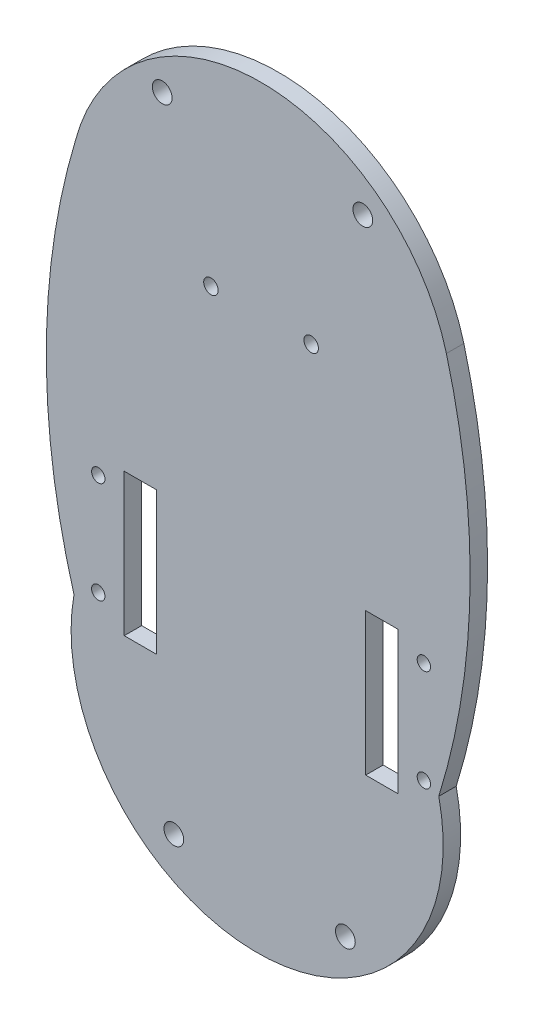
ISO-10303-21;
HEADER;
FILE_DESCRIPTION(('STEP AP214'),'2;1');
FILE_NAME('part.step','',(''),(''),'','','');
FILE_SCHEMA(('AUTOMOTIVE_DESIGN { 1 0 10303 214 1 1 1 1 }'));
ENDSEC;
DATA;
#1=APPLICATION_CONTEXT('core data for automotive mechanical design processes');
#2=APPLICATION_PROTOCOL_DEFINITION('international standard','automotive_design',2000,#1);
#3=PRODUCT_CONTEXT('',#1,'mechanical');
#4=PRODUCT('Part','Part','',(#3));
#5=PRODUCT_RELATED_PRODUCT_CATEGORY('part','',(#4));
#6=PRODUCT_DEFINITION_FORMATION('','',#4);
#7=PRODUCT_DEFINITION_CONTEXT('part definition',#1,'design');
#8=PRODUCT_DEFINITION('design','',#6,#7);
#9=PRODUCT_DEFINITION_SHAPE('','',#8);
#10=(LENGTH_UNIT() NAMED_UNIT(*) SI_UNIT(.MILLI.,.METRE.));
#11=(NAMED_UNIT(*) PLANE_ANGLE_UNIT() SI_UNIT($,.RADIAN.));
#12=(NAMED_UNIT(*) SI_UNIT($,.STERADIAN.) SOLID_ANGLE_UNIT());
#13=UNCERTAINTY_MEASURE_WITH_UNIT(LENGTH_MEASURE(1.E-05),#10,'distance_accuracy_value','');
#14=(GEOMETRIC_REPRESENTATION_CONTEXT(3) GLOBAL_UNCERTAINTY_ASSIGNED_CONTEXT((#13)) GLOBAL_UNIT_ASSIGNED_CONTEXT((#10,
#11,#12)) REPRESENTATION_CONTEXT('',''));
#15=CARTESIAN_POINT('',(0.,0.,0.));
#16=DIRECTION('',(0.,0.,1.));
#17=DIRECTION('',(1.,0.,0.));
#18=AXIS2_PLACEMENT_3D('',#15,#16,#17);
#19=CARTESIAN_POINT('',(41.1941527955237,-78.4757231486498,3.));
#20=DIRECTION('',(0.,0.,1.));
#21=DIRECTION('',(1.,0.,0.));
#22=AXIS2_PLACEMENT_3D('',#19,#20,#21);
#23=PLANE('',#22);
#24=CARTESIAN_POINT('',(-8.62,-34.7075503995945,3.));
#25=DIRECTION('',(0.,0.,1.));
#26=DIRECTION('',(1.,0.,0.));
#27=AXIS2_PLACEMENT_3D('',#24,#25,#26);
#28=CIRCLE('',#27,1.25);
#29=CARTESIAN_POINT('',(-7.37,-34.7075503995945,3.));
#30=VERTEX_POINT('',#29);
#31=EDGE_CURVE('E334',#30,#30,#28,.T.);
#32=ORIENTED_EDGE('',*,*,#31,.F.);
#33=EDGE_LOOP('',(#32));
#34=FACE_BOUND('',#33,.T.);
#35=CARTESIAN_POINT('',(8.62,-34.7075503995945,3.));
#36=DIRECTION('',(0.,0.,1.));
#37=DIRECTION('',(1.,0.,0.));
#38=AXIS2_PLACEMENT_3D('',#35,#36,#37);
#39=CIRCLE('',#38,1.25);
#40=CARTESIAN_POINT('',(9.87,-34.7075503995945,3.));
#41=VERTEX_POINT('',#40);
#42=EDGE_CURVE('E341',#41,#41,#39,.T.);
#43=ORIENTED_EDGE('',*,*,#42,.F.);
#44=EDGE_LOOP('',(#43));
#45=FACE_BOUND('',#44,.T.);
#46=DIRECTION('',(0.,1.,0.));
#47=VECTOR('',#46,1.);
#48=CARTESIAN_POINT('',(-18.,-69.7075503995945,3.));
#49=LINE('',#48,#47);
#50=CARTESIAN_POINT('',(-18.,-94.2075503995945,3.));
#51=VERTEX_POINT('',#50);
#52=CARTESIAN_POINT('',(-18.,-69.7075503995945,3.));
#53=VERTEX_POINT('',#52);
#54=EDGE_CURVE('E63',#51,#53,#49,.T.);
#55=ORIENTED_EDGE('',*,*,#54,.F.);
#56=DIRECTION('',(1.,0.,0.));
#57=VECTOR('',#56,1.);
#58=CARTESIAN_POINT('',(-23.5341140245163,-94.2075503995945,3.));
#59=LINE('',#58,#57);
#60=CARTESIAN_POINT('',(-23.5341140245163,-94.2075503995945,3.));
#61=VERTEX_POINT('',#60);
#62=EDGE_CURVE('E162',#61,#51,#59,.T.);
#63=ORIENTED_EDGE('',*,*,#62,.F.);
#64=DIRECTION('',(0.,-1.,0.));
#65=VECTOR('',#64,1.);
#66=CARTESIAN_POINT('',(-23.5341140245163,-69.7075503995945,3.));
#67=LINE('',#66,#65);
#68=CARTESIAN_POINT('',(-23.5341140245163,-69.7075503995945,3.));
#69=VERTEX_POINT('',#68);
#70=EDGE_CURVE('E144',#69,#61,#67,.T.);
#71=ORIENTED_EDGE('',*,*,#70,.F.);
#72=DIRECTION('',(-1.,0.,0.));
#73=VECTOR('',#72,1.);
#74=CARTESIAN_POINT('',(-23.5341140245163,-69.7075503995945,3.));
#75=LINE('',#74,#73);
#76=EDGE_CURVE('E155',#53,#69,#75,.T.);
#77=ORIENTED_EDGE('',*,*,#76,.F.);
#78=EDGE_LOOP('',(#55,#63,#71,#77));
#79=FACE_BOUND('',#78,.T.);
#80=DIRECTION('',(0.,1.,0.));
#81=VECTOR('',#80,1.);
#82=CARTESIAN_POINT('',(23.53,-69.7075503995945,3.));
#83=LINE('',#82,#81);
#84=CARTESIAN_POINT('',(23.53,-94.2075503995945,3.));
#85=VERTEX_POINT('',#84);
#86=CARTESIAN_POINT('',(23.53,-69.7075503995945,3.));
#87=VERTEX_POINT('',#86);
#88=EDGE_CURVE('E71',#85,#87,#83,.T.);
#89=ORIENTED_EDGE('',*,*,#88,.F.);
#90=DIRECTION('',(1.,0.,0.));
#91=VECTOR('',#90,1.);
#92=CARTESIAN_POINT('',(18.,-94.2075503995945,3.));
#93=LINE('',#92,#91);
#94=CARTESIAN_POINT('',(18.,-94.2075503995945,3.));
#95=VERTEX_POINT('',#94);
#96=EDGE_CURVE('E180',#95,#85,#93,.T.);
#97=ORIENTED_EDGE('',*,*,#96,.F.);
#98=DIRECTION('',(0.,-1.,0.));
#99=VECTOR('',#98,1.);
#100=CARTESIAN_POINT('',(18.,-69.7075503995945,3.));
#101=LINE('',#100,#99);
#102=CARTESIAN_POINT('',(18.,-69.7075503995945,3.));
#103=VERTEX_POINT('',#102);
#104=EDGE_CURVE('E193',#103,#95,#101,.T.);
#105=ORIENTED_EDGE('',*,*,#104,.F.);
#106=DIRECTION('',(-1.,0.,0.));
#107=VECTOR('',#106,1.);
#108=CARTESIAN_POINT('',(18.,-69.7075503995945,3.));
#109=LINE('',#108,#107);
#110=EDGE_CURVE('E197',#87,#103,#109,.T.);
#111=ORIENTED_EDGE('',*,*,#110,.F.);
#112=EDGE_LOOP('',(#89,#97,#105,#111));
#113=FACE_BOUND('',#112,.T.);
#114=CARTESIAN_POINT('',(-28.,-72.54,3.));
#115=DIRECTION('',(0.,0.,1.));
#116=DIRECTION('',(-1.,0.,0.));
#117=AXIS2_PLACEMENT_3D('',#114,#115,#116);
#118=CIRCLE('',#117,1.14999999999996);
#119=CARTESIAN_POINT('',(-29.15,-72.54,3.));
#120=VERTEX_POINT('',#119);
#121=EDGE_CURVE('E211',#120,#120,#118,.T.);
#122=ORIENTED_EDGE('',*,*,#121,.F.);
#123=EDGE_LOOP('',(#122));
#124=FACE_BOUND('',#123,.T.);
#125=CARTESIAN_POINT('',(-15.,-119.5,3.));
#126=DIRECTION('',(0.,0.,1.));
#127=DIRECTION('',(1.,0.,0.));
#128=AXIS2_PLACEMENT_3D('',#125,#126,#127);
#129=CIRCLE('',#128,1.70000000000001);
#130=CARTESIAN_POINT('',(-13.3,-119.5,3.));
#131=VERTEX_POINT('',#130);
#132=EDGE_CURVE('E227',#131,#131,#129,.T.);
#133=ORIENTED_EDGE('',*,*,#132,.F.);
#134=EDGE_LOOP('',(#133));
#135=FACE_BOUND('',#134,.T.);
#136=CARTESIAN_POINT('',(28.,-72.54,3.));
#137=DIRECTION('',(0.,0.,1.));
#138=DIRECTION('',(1.,0.,0.));
#139=AXIS2_PLACEMENT_3D('',#136,#137,#138);
#140=CIRCLE('',#139,1.14999999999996);
#141=CARTESIAN_POINT('',(29.15,-72.54,3.));
#142=VERTEX_POINT('',#141);
#143=EDGE_CURVE('E243',#142,#142,#140,.T.);
#144=ORIENTED_EDGE('',*,*,#143,.F.);
#145=EDGE_LOOP('',(#144));
#146=FACE_BOUND('',#145,.T.);
#147=CARTESIAN_POINT('',(14.5,-120.,3.));
#148=DIRECTION('',(0.,0.,1.));
#149=DIRECTION('',(1.,0.,0.));
#150=AXIS2_PLACEMENT_3D('',#147,#148,#149);
#151=CIRCLE('',#150,1.7);
#152=CARTESIAN_POINT('',(16.2,-120.,3.));
#153=VERTEX_POINT('',#152);
#154=EDGE_CURVE('E259',#153,#153,#151,.T.);
#155=ORIENTED_EDGE('',*,*,#154,.F.);
#156=EDGE_LOOP('',(#155));
#157=FACE_BOUND('',#156,.T.);
#158=CARTESIAN_POINT('',(83.0626903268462,-58.9443393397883,3.));
#159=DIRECTION('',(0.,0.,1.));
#160=DIRECTION('',(1.,0.,0.));
#161=AXIS2_PLACEMENT_3D('',#158,#159,#160);
#162=CIRCLE('',#161,120.);
#163=CARTESIAN_POINT('',(-31.8770093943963,-24.4644114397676,3.));
#164=VERTEX_POINT('',#163);
#165=CARTESIAN_POINT('',(-32.1793105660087,-92.4,3.));
#166=VERTEX_POINT('',#165);
#167=EDGE_CURVE('E267',#164,#166,#162,.T.);
#168=ORIENTED_EDGE('',*,*,#167,.T.);
#169=CARTESIAN_POINT('',(-0.674384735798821,-98.0071069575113,3.));
#170=DIRECTION('',(0.,0.,1.));
#171=DIRECTION('',(1.,0.,0.));
#172=AXIS2_PLACEMENT_3D('',#169,#170,#171);
#173=CIRCLE('',#172,32.);
#174=CARTESIAN_POINT('',(30.5662744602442,-91.0773729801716,3.));
#175=VERTEX_POINT('',#174);
#176=EDGE_CURVE('E271',#166,#175,#173,.T.);
#177=ORIENTED_EDGE('',*,*,#176,.T.);
#178=CARTESIAN_POINT('',(-84.0393884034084,-55.5029152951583,3.));
#179=DIRECTION('',(0.,0.,1.));
#180=DIRECTION('',(-1.,0.,0.));
#181=AXIS2_PLACEMENT_3D('',#178,#179,#180);
#182=CIRCLE('',#181,120.);
#183=CARTESIAN_POINT('',(31.8770093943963,-24.4644114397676,3.));
#184=VERTEX_POINT('',#183);
#185=EDGE_CURVE('E275',#175,#184,#182,.T.);
#186=ORIENTED_EDGE('',*,*,#185,.T.);
#187=CARTESIAN_POINT('',(0.,-33.,3.));
#188=DIRECTION('',(0.,0.,1.));
#189=DIRECTION('',(-1.,0.,0.));
#190=AXIS2_PLACEMENT_3D('',#187,#188,#189);
#191=CIRCLE('',#190,33.);
#192=EDGE_CURVE('E278',#184,#164,#191,.T.);
#193=ORIENTED_EDGE('',*,*,#192,.T.);
#194=EDGE_LOOP('',(#168,#177,#186,#193));
#195=FACE_BOUND('',#194,.T.);
#196=CARTESIAN_POINT('',(17.5,-11.,3.));
#197=DIRECTION('',(0.,0.,1.));
#198=DIRECTION('',(1.,0.,0.));
#199=AXIS2_PLACEMENT_3D('',#196,#197,#198);
#200=CIRCLE('',#199,1.7);
#201=CARTESIAN_POINT('',(19.2,-11.,3.));
#202=VERTEX_POINT('',#201);
#203=EDGE_CURVE('E251',#202,#202,#200,.T.);
#204=ORIENTED_EDGE('',*,*,#203,.F.);
#205=EDGE_LOOP('',(#204));
#206=FACE_BOUND('',#205,.T.);
#207=CARTESIAN_POINT('',(28.,-90.,3.));
#208=DIRECTION('',(0.,0.,1.));
#209=DIRECTION('',(1.,0.,0.));
#210=AXIS2_PLACEMENT_3D('',#207,#208,#209);
#211=CIRCLE('',#210,1.15);
#212=CARTESIAN_POINT('',(29.15,-90.,3.));
#213=VERTEX_POINT('',#212);
#214=EDGE_CURVE('E235',#213,#213,#211,.T.);
#215=ORIENTED_EDGE('',*,*,#214,.F.);
#216=EDGE_LOOP('',(#215));
#217=FACE_BOUND('',#216,.T.);
#218=CARTESIAN_POINT('',(-28.,-90.,3.));
#219=DIRECTION('',(0.,0.,1.));
#220=DIRECTION('',(-1.,0.,0.));
#221=AXIS2_PLACEMENT_3D('',#218,#219,#220);
#222=CIRCLE('',#221,1.15);
#223=CARTESIAN_POINT('',(-29.15,-90.,3.));
#224=VERTEX_POINT('',#223);
#225=EDGE_CURVE('E219',#224,#224,#222,.T.);
#226=ORIENTED_EDGE('',*,*,#225,.F.);
#227=EDGE_LOOP('',(#226));
#228=FACE_BOUND('',#227,.T.);
#229=CARTESIAN_POINT('',(-17.,-10.,3.));
#230=DIRECTION('',(0.,0.,1.));
#231=DIRECTION('',(1.,0.,0.));
#232=AXIS2_PLACEMENT_3D('',#229,#230,#231);
#233=CIRCLE('',#232,1.7);
#234=CARTESIAN_POINT('',(-15.3,-10.,3.));
#235=VERTEX_POINT('',#234);
#236=EDGE_CURVE('E203',#235,#235,#233,.T.);
#237=ORIENTED_EDGE('',*,*,#236,.F.);
#238=EDGE_LOOP('',(#237));
#239=FACE_BOUND('',#238,.T.);
#240=ADVANCED_FACE('F45',(#34,#45,#79,#113,#124,#135,#146,#157,#195,#206,#217,#228,#239),#23,.T.);
#241=CARTESIAN_POINT('',(41.1941527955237,-78.4757231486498,0.));
#242=DIRECTION('',(0.,0.,1.));
#243=DIRECTION('',(1.,0.,0.));
#244=AXIS2_PLACEMENT_3D('',#241,#242,#243);
#245=PLANE('',#244);
#246=CARTESIAN_POINT('',(-8.62,-34.7075503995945,0.));
#247=DIRECTION('',(0.,0.,1.));
#248=DIRECTION('',(1.,0.,0.));
#249=AXIS2_PLACEMENT_3D('',#246,#247,#248);
#250=CIRCLE('',#249,1.25);
#251=CARTESIAN_POINT('',(-7.37,-34.7075503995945,0.));
#252=VERTEX_POINT('',#251);
#253=EDGE_CURVE('E49',#252,#252,#250,.T.);
#254=ORIENTED_EDGE('',*,*,#253,.T.);
#255=EDGE_LOOP('',(#254));
#256=FACE_BOUND('',#255,.T.);
#257=CARTESIAN_POINT('',(8.62,-34.7075503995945,0.));
#258=DIRECTION('',(0.,0.,1.));
#259=DIRECTION('',(1.,0.,0.));
#260=AXIS2_PLACEMENT_3D('',#257,#258,#259);
#261=CIRCLE('',#260,1.25);
#262=CARTESIAN_POINT('',(9.87,-34.7075503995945,0.));
#263=VERTEX_POINT('',#262);
#264=EDGE_CURVE('E331',#263,#263,#261,.T.);
#265=ORIENTED_EDGE('',*,*,#264,.T.);
#266=EDGE_LOOP('',(#265));
#267=FACE_BOUND('',#266,.T.);
#268=DIRECTION('',(1.,0.,0.));
#269=VECTOR('',#268,1.);
#270=CARTESIAN_POINT('',(41.1941527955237,-94.2075503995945,0.));
#271=LINE('',#270,#269);
#272=CARTESIAN_POINT('',(-23.5341140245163,-94.2075503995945,0.));
#273=VERTEX_POINT('',#272);
#274=CARTESIAN_POINT('',(-18.,-94.2075503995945,0.));
#275=VERTEX_POINT('',#274);
#276=EDGE_CURVE('E55',#273,#275,#271,.T.);
#277=ORIENTED_EDGE('',*,*,#276,.T.);
#278=DIRECTION('',(0.,1.,0.));
#279=VECTOR('',#278,1.);
#280=CARTESIAN_POINT('',(-18.,-78.4757231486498,0.));
#281=LINE('',#280,#279);
#282=CARTESIAN_POINT('',(-18.,-69.7075503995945,0.));
#283=VERTEX_POINT('',#282);
#284=EDGE_CURVE('E11',#275,#283,#281,.T.);
#285=ORIENTED_EDGE('',*,*,#284,.T.);
#286=DIRECTION('',(-1.,0.,0.));
#287=VECTOR('',#286,1.);
#288=CARTESIAN_POINT('',(41.1941527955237,-69.7075503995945,0.));
#289=LINE('',#288,#287);
#290=CARTESIAN_POINT('',(-23.5341140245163,-69.7075503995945,0.));
#291=VERTEX_POINT('',#290);
#292=EDGE_CURVE('E324',#283,#291,#289,.T.);
#293=ORIENTED_EDGE('',*,*,#292,.T.);
#294=DIRECTION('',(0.,-1.,0.));
#295=VECTOR('',#294,1.);
#296=CARTESIAN_POINT('',(-23.5341140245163,-78.4757231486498,0.));
#297=LINE('',#296,#295);
#298=EDGE_CURVE('E147',#291,#273,#297,.T.);
#299=ORIENTED_EDGE('',*,*,#298,.T.);
#300=EDGE_LOOP('',(#277,#285,#293,#299));
#301=FACE_BOUND('',#300,.T.);
#302=DIRECTION('',(1.,0.,0.));
#303=VECTOR('',#302,1.);
#304=CARTESIAN_POINT('',(41.1941527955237,-94.2075503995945,0.));
#305=LINE('',#304,#303);
#306=CARTESIAN_POINT('',(18.,-94.2075503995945,0.));
#307=VERTEX_POINT('',#306);
#308=CARTESIAN_POINT('',(23.53,-94.2075503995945,0.));
#309=VERTEX_POINT('',#308);
#310=EDGE_CURVE('E316',#307,#309,#305,.T.);
#311=ORIENTED_EDGE('',*,*,#310,.T.);
#312=DIRECTION('',(0.,1.,0.));
#313=VECTOR('',#312,1.);
#314=CARTESIAN_POINT('',(23.53,-78.4757231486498,0.));
#315=LINE('',#314,#313);
#316=CARTESIAN_POINT('',(23.53,-69.7075503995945,0.));
#317=VERTEX_POINT('',#316);
#318=EDGE_CURVE('E320',#309,#317,#315,.T.);
#319=ORIENTED_EDGE('',*,*,#318,.T.);
#320=DIRECTION('',(-1.,0.,0.));
#321=VECTOR('',#320,1.);
#322=CARTESIAN_POINT('',(41.1941527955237,-69.7075503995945,0.));
#323=LINE('',#322,#321);
#324=CARTESIAN_POINT('',(18.,-69.7075503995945,0.));
#325=VERTEX_POINT('',#324);
#326=EDGE_CURVE('E308',#317,#325,#323,.T.);
#327=ORIENTED_EDGE('',*,*,#326,.T.);
#328=DIRECTION('',(0.,-1.,0.));
#329=VECTOR('',#328,1.);
#330=CARTESIAN_POINT('',(18.,-78.4757231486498,0.));
#331=LINE('',#330,#329);
#332=EDGE_CURVE('E312',#325,#307,#331,.T.);
#333=ORIENTED_EDGE('',*,*,#332,.T.);
#334=EDGE_LOOP('',(#311,#319,#327,#333));
#335=FACE_BOUND('',#334,.T.);
#336=CARTESIAN_POINT('',(83.0626903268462,-58.9443393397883,0.));
#337=DIRECTION('',(0.,0.,1.));
#338=DIRECTION('',(1.,0.,0.));
#339=AXIS2_PLACEMENT_3D('',#336,#337,#338);
#340=CIRCLE('',#339,120.);
#341=CARTESIAN_POINT('',(-31.8770093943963,-24.4644114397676,0.));
#342=VERTEX_POINT('',#341);
#343=CARTESIAN_POINT('',(-32.1793105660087,-92.4,0.));
#344=VERTEX_POINT('',#343);
#345=EDGE_CURVE('E263',#342,#344,#340,.T.);
#346=ORIENTED_EDGE('',*,*,#345,.F.);
#347=CARTESIAN_POINT('',(0.,-33.,0.));
#348=DIRECTION('',(0.,0.,1.));
#349=DIRECTION('',(-1.,0.,0.));
#350=AXIS2_PLACEMENT_3D('',#347,#348,#349);
#351=CIRCLE('',#350,33.);
#352=CARTESIAN_POINT('',(31.8770093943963,-24.4644114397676,0.));
#353=VERTEX_POINT('',#352);
#354=EDGE_CURVE('E272',#353,#342,#351,.T.);
#355=ORIENTED_EDGE('',*,*,#354,.F.);
#356=CARTESIAN_POINT('',(-84.0393884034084,-55.5029152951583,0.));
#357=DIRECTION('',(0.,0.,1.));
#358=DIRECTION('',(-1.,0.,0.));
#359=AXIS2_PLACEMENT_3D('',#356,#357,#358);
#360=CIRCLE('',#359,120.);
#361=CARTESIAN_POINT('',(30.5662744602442,-91.0773729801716,0.));
#362=VERTEX_POINT('',#361);
#363=EDGE_CURVE('E288',#362,#353,#360,.T.);
#364=ORIENTED_EDGE('',*,*,#363,.F.);
#365=CARTESIAN_POINT('',(-0.674384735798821,-98.0071069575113,0.));
#366=DIRECTION('',(0.,0.,1.));
#367=DIRECTION('',(1.,0.,0.));
#368=AXIS2_PLACEMENT_3D('',#365,#366,#367);
#369=CIRCLE('',#368,32.);
#370=EDGE_CURVE('E285',#344,#362,#369,.T.);
#371=ORIENTED_EDGE('',*,*,#370,.F.);
#372=EDGE_LOOP('',(#346,#355,#364,#371));
#373=FACE_BOUND('',#372,.T.);
#374=CARTESIAN_POINT('',(14.5,-120.,0.));
#375=DIRECTION('',(0.,0.,1.));
#376=DIRECTION('',(1.,0.,0.));
#377=AXIS2_PLACEMENT_3D('',#374,#375,#376);
#378=CIRCLE('',#377,1.7);
#379=CARTESIAN_POINT('',(16.2,-120.,0.));
#380=VERTEX_POINT('',#379);
#381=EDGE_CURVE('E255',#380,#380,#378,.T.);
#382=ORIENTED_EDGE('',*,*,#381,.T.);
#383=EDGE_LOOP('',(#382));
#384=FACE_BOUND('',#383,.T.);
#385=CARTESIAN_POINT('',(17.5,-11.,0.));
#386=DIRECTION('',(0.,0.,1.));
#387=DIRECTION('',(1.,0.,0.));
#388=AXIS2_PLACEMENT_3D('',#385,#386,#387);
#389=CIRCLE('',#388,1.7);
#390=CARTESIAN_POINT('',(19.2,-11.,0.));
#391=VERTEX_POINT('',#390);
#392=EDGE_CURVE('E247',#391,#391,#389,.T.);
#393=ORIENTED_EDGE('',*,*,#392,.T.);
#394=EDGE_LOOP('',(#393));
#395=FACE_BOUND('',#394,.T.);
#396=CARTESIAN_POINT('',(28.,-72.54,0.));
#397=DIRECTION('',(0.,0.,1.));
#398=DIRECTION('',(1.,0.,0.));
#399=AXIS2_PLACEMENT_3D('',#396,#397,#398);
#400=CIRCLE('',#399,1.14999999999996);
#401=CARTESIAN_POINT('',(29.15,-72.54,0.));
#402=VERTEX_POINT('',#401);
#403=EDGE_CURVE('E239',#402,#402,#400,.T.);
#404=ORIENTED_EDGE('',*,*,#403,.T.);
#405=EDGE_LOOP('',(#404));
#406=FACE_BOUND('',#405,.T.);
#407=CARTESIAN_POINT('',(28.,-90.,0.));
#408=DIRECTION('',(0.,0.,1.));
#409=DIRECTION('',(1.,0.,0.));
#410=AXIS2_PLACEMENT_3D('',#407,#408,#409);
#411=CIRCLE('',#410,1.15);
#412=CARTESIAN_POINT('',(29.15,-90.,0.));
#413=VERTEX_POINT('',#412);
#414=EDGE_CURVE('E231',#413,#413,#411,.T.);
#415=ORIENTED_EDGE('',*,*,#414,.T.);
#416=EDGE_LOOP('',(#415));
#417=FACE_BOUND('',#416,.T.);
#418=CARTESIAN_POINT('',(-15.,-119.5,0.));
#419=DIRECTION('',(0.,0.,1.));
#420=DIRECTION('',(1.,0.,0.));
#421=AXIS2_PLACEMENT_3D('',#418,#419,#420);
#422=CIRCLE('',#421,1.70000000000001);
#423=CARTESIAN_POINT('',(-13.3,-119.5,0.));
#424=VERTEX_POINT('',#423);
#425=EDGE_CURVE('E223',#424,#424,#422,.T.);
#426=ORIENTED_EDGE('',*,*,#425,.T.);
#427=EDGE_LOOP('',(#426));
#428=FACE_BOUND('',#427,.T.);
#429=CARTESIAN_POINT('',(-28.,-90.,0.));
#430=DIRECTION('',(0.,0.,1.));
#431=DIRECTION('',(-1.,0.,0.));
#432=AXIS2_PLACEMENT_3D('',#429,#430,#431);
#433=CIRCLE('',#432,1.15);
#434=CARTESIAN_POINT('',(-29.15,-90.,0.));
#435=VERTEX_POINT('',#434);
#436=EDGE_CURVE('E215',#435,#435,#433,.T.);
#437=ORIENTED_EDGE('',*,*,#436,.T.);
#438=EDGE_LOOP('',(#437));
#439=FACE_BOUND('',#438,.T.);
#440=CARTESIAN_POINT('',(-28.,-72.54,0.));
#441=DIRECTION('',(0.,0.,1.));
#442=DIRECTION('',(-1.,0.,0.));
#443=AXIS2_PLACEMENT_3D('',#440,#441,#442);
#444=CIRCLE('',#443,1.14999999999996);
#445=CARTESIAN_POINT('',(-29.15,-72.54,0.));
#446=VERTEX_POINT('',#445);
#447=EDGE_CURVE('E207',#446,#446,#444,.T.);
#448=ORIENTED_EDGE('',*,*,#447,.T.);
#449=EDGE_LOOP('',(#448));
#450=FACE_BOUND('',#449,.T.);
#451=CARTESIAN_POINT('',(-17.,-10.,0.));
#452=DIRECTION('',(0.,0.,1.));
#453=DIRECTION('',(1.,0.,0.));
#454=AXIS2_PLACEMENT_3D('',#451,#452,#453);
#455=CIRCLE('',#454,1.7);
#456=CARTESIAN_POINT('',(-15.3,-10.,0.));
#457=VERTEX_POINT('',#456);
#458=EDGE_CURVE('E172',#457,#457,#455,.T.);
#459=ORIENTED_EDGE('',*,*,#458,.T.);
#460=EDGE_LOOP('',(#459));
#461=FACE_BOUND('',#460,.T.);
#462=ADVANCED_FACE('F355',(#256,#267,#301,#335,#373,#384,#395,#406,#417,#428,#439,#450,#461),
#245,.F.);
#463=CARTESIAN_POINT('',(83.0626903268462,-58.9443393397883,3.));
#464=DIRECTION('',(0.,0.,-1.));
#465=DIRECTION('',(-1.,0.,0.));
#466=AXIS2_PLACEMENT_3D('',#463,#464,#465);
#467=CYLINDRICAL_SURFACE('',#466,120.);
#468=ORIENTED_EDGE('',*,*,#345,.T.);
#469=DIRECTION('',(0.,0.,-1.));
#470=VECTOR('',#469,1.);
#471=CARTESIAN_POINT('',(-32.1793105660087,-92.4,3.));
#472=LINE('',#471,#470);
#473=EDGE_CURVE('E304',#166,#344,#472,.T.);
#474=ORIENTED_EDGE('',*,*,#473,.F.);
#475=ORIENTED_EDGE('',*,*,#167,.F.);
#476=DIRECTION('',(0.,0.,-1.));
#477=VECTOR('',#476,1.);
#478=CARTESIAN_POINT('',(-31.8770093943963,-24.4644114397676,3.));
#479=LINE('',#478,#477);
#480=EDGE_CURVE('E281',#164,#342,#479,.T.);
#481=ORIENTED_EDGE('',*,*,#480,.T.);
#482=EDGE_LOOP('',(#468,#474,#475,#481));
#483=FACE_BOUND('',#482,.T.);
#484=ADVANCED_FACE('F47',(#483),#467,.T.);
#485=CARTESIAN_POINT('',(-0.674384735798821,-98.0071069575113,3.));
#486=DIRECTION('',(0.,0.,-1.));
#487=DIRECTION('',(-1.,0.,0.));
#488=AXIS2_PLACEMENT_3D('',#485,#486,#487);
#489=CYLINDRICAL_SURFACE('',#488,32.);
#490=ORIENTED_EDGE('',*,*,#370,.T.);
#491=DIRECTION('',(0.,0.,-1.));
#492=VECTOR('',#491,1.);
#493=CARTESIAN_POINT('',(30.5662744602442,-91.0773729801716,3.));
#494=LINE('',#493,#492);
#495=EDGE_CURVE('E300',#175,#362,#494,.T.);
#496=ORIENTED_EDGE('',*,*,#495,.F.);
#497=ORIENTED_EDGE('',*,*,#176,.F.);
#498=ORIENTED_EDGE('',*,*,#473,.T.);
#499=EDGE_LOOP('',(#490,#496,#497,#498));
#500=FACE_BOUND('',#499,.T.);
#501=ADVANCED_FACE('F373',(#500),#489,.T.);
#502=CARTESIAN_POINT('',(-84.0393884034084,-55.5029152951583,3.));
#503=DIRECTION('',(0.,0.,-1.));
#504=DIRECTION('',(-1.,0.,0.));
#505=AXIS2_PLACEMENT_3D('',#502,#503,#504);
#506=CYLINDRICAL_SURFACE('',#505,120.);
#507=ORIENTED_EDGE('',*,*,#363,.T.);
#508=DIRECTION('',(0.,0.,-1.));
#509=VECTOR('',#508,1.);
#510=CARTESIAN_POINT('',(31.8770093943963,-24.4644114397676,3.));
#511=LINE('',#510,#509);
#512=EDGE_CURVE('E296',#184,#353,#511,.T.);
#513=ORIENTED_EDGE('',*,*,#512,.F.);
#514=ORIENTED_EDGE('',*,*,#185,.F.);
#515=ORIENTED_EDGE('',*,*,#495,.T.);
#516=EDGE_LOOP('',(#507,#513,#514,#515));
#517=FACE_BOUND('',#516,.T.);
#518=ADVANCED_FACE('F370',(#517),#506,.T.);
#519=CARTESIAN_POINT('',(0.,-33.,3.));
#520=DIRECTION('',(0.,0.,-1.));
#521=DIRECTION('',(-1.,0.,0.));
#522=AXIS2_PLACEMENT_3D('',#519,#520,#521);
#523=CYLINDRICAL_SURFACE('',#522,33.);
#524=ORIENTED_EDGE('',*,*,#354,.T.);
#525=ORIENTED_EDGE('',*,*,#480,.F.);
#526=ORIENTED_EDGE('',*,*,#192,.F.);
#527=ORIENTED_EDGE('',*,*,#512,.T.);
#528=EDGE_LOOP('',(#524,#525,#526,#527));
#529=FACE_BOUND('',#528,.T.);
#530=ADVANCED_FACE('F367',(#529),#523,.T.);
#531=CARTESIAN_POINT('',(14.5,-120.,3.));
#532=DIRECTION('',(0.,0.,-1.));
#533=DIRECTION('',(-1.,0.,0.));
#534=AXIS2_PLACEMENT_3D('',#531,#532,#533);
#535=CYLINDRICAL_SURFACE('',#534,1.7);
#536=ORIENTED_EDGE('',*,*,#154,.T.);
#537=EDGE_LOOP('',(#536));
#538=FACE_BOUND('',#537,.T.);
#539=ORIENTED_EDGE('',*,*,#381,.F.);
#540=EDGE_LOOP('',(#539));
#541=FACE_BOUND('',#540,.T.);
#542=ADVANCED_FACE('F364',(#538,#541),#535,.F.);
#543=CARTESIAN_POINT('',(17.5,-11.,3.));
#544=DIRECTION('',(0.,0.,-1.));
#545=DIRECTION('',(-1.,0.,0.));
#546=AXIS2_PLACEMENT_3D('',#543,#544,#545);
#547=CYLINDRICAL_SURFACE('',#546,1.7);
#548=ORIENTED_EDGE('',*,*,#203,.T.);
#549=EDGE_LOOP('',(#548));
#550=FACE_BOUND('',#549,.T.);
#551=ORIENTED_EDGE('',*,*,#392,.F.);
#552=EDGE_LOOP('',(#551));
#553=FACE_BOUND('',#552,.T.);
#554=ADVANCED_FACE('F436',(#550,#553),#547,.F.);
#555=CARTESIAN_POINT('',(28.,-72.54,3.));
#556=DIRECTION('',(0.,0.,-1.));
#557=DIRECTION('',(-1.,0.,0.));
#558=AXIS2_PLACEMENT_3D('',#555,#556,#557);
#559=CYLINDRICAL_SURFACE('',#558,1.14999999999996);
#560=ORIENTED_EDGE('',*,*,#143,.T.);
#561=EDGE_LOOP('',(#560));
#562=FACE_BOUND('',#561,.T.);
#563=ORIENTED_EDGE('',*,*,#403,.F.);
#564=EDGE_LOOP('',(#563));
#565=FACE_BOUND('',#564,.T.);
#566=ADVANCED_FACE('F433',(#562,#565),#559,.F.);
#567=CARTESIAN_POINT('',(28.,-90.,3.));
#568=DIRECTION('',(0.,0.,-1.));
#569=DIRECTION('',(-1.,0.,0.));
#570=AXIS2_PLACEMENT_3D('',#567,#568,#569);
#571=CYLINDRICAL_SURFACE('',#570,1.15);
#572=ORIENTED_EDGE('',*,*,#214,.T.);
#573=EDGE_LOOP('',(#572));
#574=FACE_BOUND('',#573,.T.);
#575=ORIENTED_EDGE('',*,*,#414,.F.);
#576=EDGE_LOOP('',(#575));
#577=FACE_BOUND('',#576,.T.);
#578=ADVANCED_FACE('F429',(#574,#577),#571,.F.);
#579=CARTESIAN_POINT('',(-15.,-119.5,3.));
#580=DIRECTION('',(0.,0.,-1.));
#581=DIRECTION('',(-1.,0.,0.));
#582=AXIS2_PLACEMENT_3D('',#579,#580,#581);
#583=CYLINDRICAL_SURFACE('',#582,1.70000000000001);
#584=ORIENTED_EDGE('',*,*,#132,.T.);
#585=EDGE_LOOP('',(#584));
#586=FACE_BOUND('',#585,.T.);
#587=ORIENTED_EDGE('',*,*,#425,.F.);
#588=EDGE_LOOP('',(#587));
#589=FACE_BOUND('',#588,.T.);
#590=ADVANCED_FACE('F425',(#586,#589),#583,.F.);
#591=CARTESIAN_POINT('',(-28.,-90.,3.));
#592=DIRECTION('',(0.,0.,-1.));
#593=DIRECTION('',(-1.,0.,0.));
#594=AXIS2_PLACEMENT_3D('',#591,#592,#593);
#595=CYLINDRICAL_SURFACE('',#594,1.15);
#596=ORIENTED_EDGE('',*,*,#225,.T.);
#597=EDGE_LOOP('',(#596));
#598=FACE_BOUND('',#597,.T.);
#599=ORIENTED_EDGE('',*,*,#436,.F.);
#600=EDGE_LOOP('',(#599));
#601=FACE_BOUND('',#600,.T.);
#602=ADVANCED_FACE('F417',(#598,#601),#595,.F.);
#603=CARTESIAN_POINT('',(-28.,-72.54,3.));
#604=DIRECTION('',(0.,0.,-1.));
#605=DIRECTION('',(-1.,0.,0.));
#606=AXIS2_PLACEMENT_3D('',#603,#604,#605);
#607=CYLINDRICAL_SURFACE('',#606,1.14999999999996);
#608=ORIENTED_EDGE('',*,*,#121,.T.);
#609=EDGE_LOOP('',(#608));
#610=FACE_BOUND('',#609,.T.);
#611=ORIENTED_EDGE('',*,*,#447,.F.);
#612=EDGE_LOOP('',(#611));
#613=FACE_BOUND('',#612,.T.);
#614=ADVANCED_FACE('F407',(#610,#613),#607,.F.);
#615=CARTESIAN_POINT('',(-17.,-10.,3.));
#616=DIRECTION('',(0.,0.,-1.));
#617=DIRECTION('',(-1.,0.,0.));
#618=AXIS2_PLACEMENT_3D('',#615,#616,#617);
#619=CYLINDRICAL_SURFACE('',#618,1.7);
#620=ORIENTED_EDGE('',*,*,#236,.T.);
#621=EDGE_LOOP('',(#620));
#622=FACE_BOUND('',#621,.T.);
#623=ORIENTED_EDGE('',*,*,#458,.F.);
#624=EDGE_LOOP('',(#623));
#625=FACE_BOUND('',#624,.T.);
#626=ADVANCED_FACE('F403',(#622,#625),#619,.F.);
#627=CARTESIAN_POINT('',(23.53,-69.7075503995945,-7.));
#628=DIRECTION('',(1.,0.,0.));
#629=DIRECTION('',(0.,0.,-1.));
#630=AXIS2_PLACEMENT_3D('',#627,#628,#629);
#631=PLANE('',#630);
#632=DIRECTION('',(0.,0.,1.));
#633=VECTOR('',#632,1.);
#634=CARTESIAN_POINT('',(23.53,-94.2075503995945,-7.));
#635=LINE('',#634,#633);
#636=EDGE_CURVE('E187',#309,#85,#635,.T.);
#637=ORIENTED_EDGE('',*,*,#636,.T.);
#638=ORIENTED_EDGE('',*,*,#88,.T.);
#639=DIRECTION('',(0.,0.,1.));
#640=VECTOR('',#639,1.);
#641=CARTESIAN_POINT('',(23.53,-69.7075503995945,-7.));
#642=LINE('',#641,#640);
#643=EDGE_CURVE('E177',#317,#87,#642,.T.);
#644=ORIENTED_EDGE('',*,*,#643,.F.);
#645=ORIENTED_EDGE('',*,*,#318,.F.);
#646=EDGE_LOOP('',(#637,#638,#644,#645));
#647=FACE_BOUND('',#646,.T.);
#648=ADVANCED_FACE('F406',(#647),#631,.F.);
#649=CARTESIAN_POINT('',(18.,-94.2075503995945,-7.));
#650=DIRECTION('',(0.,-1.,0.));
#651=DIRECTION('',(0.,0.,-1.));
#652=AXIS2_PLACEMENT_3D('',#649,#650,#651);
#653=PLANE('',#652);
#654=DIRECTION('',(0.,0.,1.));
#655=VECTOR('',#654,1.);
#656=CARTESIAN_POINT('',(18.,-94.2075503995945,-7.));
#657=LINE('',#656,#655);
#658=EDGE_CURVE('E184',#307,#95,#657,.T.);
#659=ORIENTED_EDGE('',*,*,#658,.T.);
#660=ORIENTED_EDGE('',*,*,#96,.T.);
#661=ORIENTED_EDGE('',*,*,#636,.F.);
#662=ORIENTED_EDGE('',*,*,#310,.F.);
#663=EDGE_LOOP('',(#659,#660,#661,#662));
#664=FACE_BOUND('',#663,.T.);
#665=ADVANCED_FACE('F415',(#664),#653,.F.);
#666=CARTESIAN_POINT('',(18.,-69.7075503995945,-7.));
#667=DIRECTION('',(-1.,0.,0.));
#668=DIRECTION('',(0.,0.,1.));
#669=AXIS2_PLACEMENT_3D('',#666,#667,#668);
#670=PLANE('',#669);
#671=DIRECTION('',(0.,0.,1.));
#672=VECTOR('',#671,1.);
#673=CARTESIAN_POINT('',(18.,-69.7075503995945,-7.));
#674=LINE('',#673,#672);
#675=EDGE_CURVE('E181',#325,#103,#674,.T.);
#676=ORIENTED_EDGE('',*,*,#675,.T.);
#677=ORIENTED_EDGE('',*,*,#104,.T.);
#678=ORIENTED_EDGE('',*,*,#658,.F.);
#679=ORIENTED_EDGE('',*,*,#332,.F.);
#680=EDGE_LOOP('',(#676,#677,#678,#679));
#681=FACE_BOUND('',#680,.T.);
#682=ADVANCED_FACE('F564',(#681),#670,.F.);
#683=CARTESIAN_POINT('',(18.,-69.7075503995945,-7.));
#684=DIRECTION('',(0.,1.,0.));
#685=DIRECTION('',(0.,0.,1.));
#686=AXIS2_PLACEMENT_3D('',#683,#684,#685);
#687=PLANE('',#686);
#688=ORIENTED_EDGE('',*,*,#643,.T.);
#689=ORIENTED_EDGE('',*,*,#110,.T.);
#690=ORIENTED_EDGE('',*,*,#675,.F.);
#691=ORIENTED_EDGE('',*,*,#326,.F.);
#692=EDGE_LOOP('',(#688,#689,#690,#691));
#693=FACE_BOUND('',#692,.T.);
#694=ADVANCED_FACE('F555',(#693),#687,.F.);
#695=CARTESIAN_POINT('',(-18.,-69.7075503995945,-7.));
#696=DIRECTION('',(1.,0.,0.));
#697=DIRECTION('',(0.,1.,0.));
#698=AXIS2_PLACEMENT_3D('',#695,#696,#697);
#699=PLANE('',#698);
#700=DIRECTION('',(0.,0.,1.));
#701=VECTOR('',#700,1.);
#702=CARTESIAN_POINT('',(-18.,-94.2075503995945,-7.));
#703=LINE('',#702,#701);
#704=EDGE_CURVE('E169',#275,#51,#703,.T.);
#705=ORIENTED_EDGE('',*,*,#704,.T.);
#706=ORIENTED_EDGE('',*,*,#54,.T.);
#707=DIRECTION('',(0.,0.,1.));
#708=VECTOR('',#707,1.);
#709=CARTESIAN_POINT('',(-18.,-69.7075503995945,-7.));
#710=LINE('',#709,#708);
#711=EDGE_CURVE('E152',#283,#53,#710,.T.);
#712=ORIENTED_EDGE('',*,*,#711,.F.);
#713=ORIENTED_EDGE('',*,*,#284,.F.);
#714=EDGE_LOOP('',(#705,#706,#712,#713));
#715=FACE_BOUND('',#714,.T.);
#716=ADVANCED_FACE('F545',(#715),#699,.F.);
#717=CARTESIAN_POINT('',(-23.5341140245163,-94.2075503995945,-7.));
#718=DIRECTION('',(0.,-1.,0.));
#719=DIRECTION('',(0.,0.,-1.));
#720=AXIS2_PLACEMENT_3D('',#717,#718,#719);
#721=PLANE('',#720);
#722=DIRECTION('',(0.,0.,1.));
#723=VECTOR('',#722,1.);
#724=CARTESIAN_POINT('',(-23.5341140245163,-94.2075503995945,-7.));
#725=LINE('',#724,#723);
#726=EDGE_CURVE('E151',#273,#61,#725,.T.);
#727=ORIENTED_EDGE('',*,*,#726,.T.);
#728=ORIENTED_EDGE('',*,*,#62,.T.);
#729=ORIENTED_EDGE('',*,*,#704,.F.);
#730=ORIENTED_EDGE('',*,*,#276,.F.);
#731=EDGE_LOOP('',(#727,#728,#729,#730));
#732=FACE_BOUND('',#731,.T.);
#733=ADVANCED_FACE('F536',(#732),#721,.F.);
#734=CARTESIAN_POINT('',(-23.5341140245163,-69.7075503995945,-7.));
#735=DIRECTION('',(-1.,0.,0.));
#736=DIRECTION('',(0.,-1.,0.));
#737=AXIS2_PLACEMENT_3D('',#734,#735,#736);
#738=PLANE('',#737);
#739=DIRECTION('',(0.,0.,1.));
#740=VECTOR('',#739,1.);
#741=CARTESIAN_POINT('',(-23.5341140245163,-69.7075503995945,-7.));
#742=LINE('',#741,#740);
#743=EDGE_CURVE('E139',#291,#69,#742,.T.);
#744=ORIENTED_EDGE('',*,*,#743,.T.);
#745=ORIENTED_EDGE('',*,*,#70,.T.);
#746=ORIENTED_EDGE('',*,*,#726,.F.);
#747=ORIENTED_EDGE('',*,*,#298,.F.);
#748=EDGE_LOOP('',(#744,#745,#746,#747));
#749=FACE_BOUND('',#748,.T.);
#750=ADVANCED_FACE('F141',(#749),#738,.F.);
#751=CARTESIAN_POINT('',(-23.5341140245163,-69.7075503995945,-7.));
#752=DIRECTION('',(0.,1.,0.));
#753=DIRECTION('',(0.,0.,1.));
#754=AXIS2_PLACEMENT_3D('',#751,#752,#753);
#755=PLANE('',#754);
#756=ORIENTED_EDGE('',*,*,#711,.T.);
#757=ORIENTED_EDGE('',*,*,#76,.T.);
#758=ORIENTED_EDGE('',*,*,#743,.F.);
#759=ORIENTED_EDGE('',*,*,#292,.F.);
#760=EDGE_LOOP('',(#756,#757,#758,#759));
#761=FACE_BOUND('',#760,.T.);
#762=ADVANCED_FACE('F156',(#761),#755,.F.);
#763=CARTESIAN_POINT('',(8.62,-34.7075503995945,-7.));
#764=DIRECTION('',(0.,0.,1.));
#765=DIRECTION('',(1.,0.,0.));
#766=AXIS2_PLACEMENT_3D('',#763,#764,#765);
#767=CYLINDRICAL_SURFACE('',#766,1.25);
#768=ORIENTED_EDGE('',*,*,#42,.T.);
#769=EDGE_LOOP('',(#768));
#770=FACE_BOUND('',#769,.T.);
#771=ORIENTED_EDGE('',*,*,#264,.F.);
#772=EDGE_LOOP('',(#771));
#773=FACE_BOUND('',#772,.T.);
#774=ADVANCED_FACE('F351',(#770,#773),#767,.F.);
#775=CARTESIAN_POINT('',(-8.62,-34.7075503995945,-7.));
#776=DIRECTION('',(0.,0.,1.));
#777=DIRECTION('',(1.,0.,0.));
#778=AXIS2_PLACEMENT_3D('',#775,#776,#777);
#779=CYLINDRICAL_SURFACE('',#778,1.25);
#780=ORIENTED_EDGE('',*,*,#31,.T.);
#781=EDGE_LOOP('',(#780));
#782=FACE_BOUND('',#781,.T.);
#783=ORIENTED_EDGE('',*,*,#253,.F.);
#784=EDGE_LOOP('',(#783));
#785=FACE_BOUND('',#784,.T.);
#786=ADVANCED_FACE('F508',(#782,#785),#779,.F.);
#787=CLOSED_SHELL('',(#240,#462,#484,#501,#518,#530,#542,#554,#566,#578,#590,#602,#614,#626,
#648,#665,#682,#694,#716,#733,#750,#762,#774,#786));
#788=MANIFOLD_SOLID_BREP('B2',#787);
#789=ADVANCED_BREP_SHAPE_REPRESENTATION('',(#18,#788),#14);
#790=SHAPE_DEFINITION_REPRESENTATION(#9,#789);
ENDSEC;
END-ISO-10303-21;
